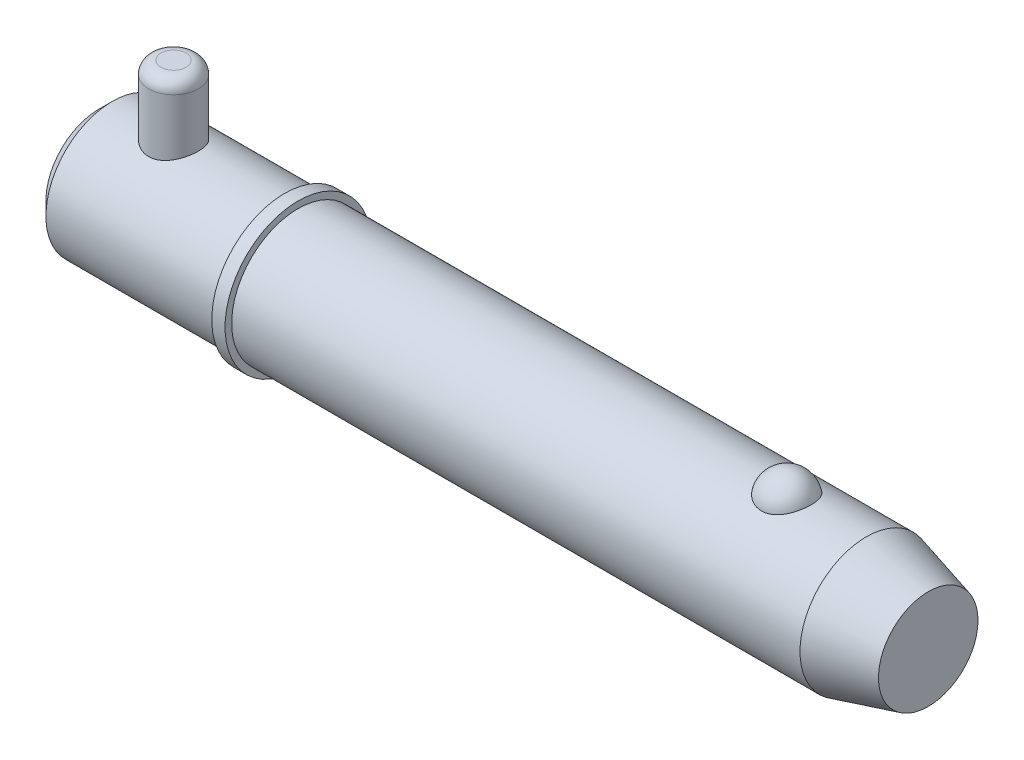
ISO-10303-21;
HEADER;
FILE_DESCRIPTION(('STEP AP214'),'2;1');
FILE_NAME('part.step','',(''),(''),'','','');
FILE_SCHEMA(('AUTOMOTIVE_DESIGN { 1 0 10303 214 1 1 1 1 }'));
ENDSEC;
DATA;
#1=APPLICATION_CONTEXT('core data for automotive mechanical design processes');
#2=APPLICATION_PROTOCOL_DEFINITION('international standard','automotive_design',2000,#1);
#3=PRODUCT_CONTEXT('',#1,'mechanical');
#4=PRODUCT('Part','Part','',(#3));
#5=PRODUCT_RELATED_PRODUCT_CATEGORY('part','',(#4));
#6=PRODUCT_DEFINITION_FORMATION('','',#4);
#7=PRODUCT_DEFINITION_CONTEXT('part definition',#1,'design');
#8=PRODUCT_DEFINITION('design','',#6,#7);
#9=PRODUCT_DEFINITION_SHAPE('','',#8);
#10=(LENGTH_UNIT() NAMED_UNIT(*) SI_UNIT(.MILLI.,.METRE.));
#11=(NAMED_UNIT(*) PLANE_ANGLE_UNIT() SI_UNIT($,.RADIAN.));
#12=(NAMED_UNIT(*) SI_UNIT($,.STERADIAN.) SOLID_ANGLE_UNIT());
#13=UNCERTAINTY_MEASURE_WITH_UNIT(LENGTH_MEASURE(1.E-05),#10,'distance_accuracy_value','');
#14=(GEOMETRIC_REPRESENTATION_CONTEXT(3) GLOBAL_UNCERTAINTY_ASSIGNED_CONTEXT((#13)) GLOBAL_UNIT_ASSIGNED_CONTEXT((#10,
#11,#12)) REPRESENTATION_CONTEXT('',''));
#15=CARTESIAN_POINT('',(0.,0.,0.));
#16=DIRECTION('',(0.,0.,1.));
#17=DIRECTION('',(1.,0.,0.));
#18=AXIS2_PLACEMENT_3D('',#15,#16,#17);
#19=CARTESIAN_POINT('',(14.28,25.4,0.));
#20=DIRECTION('',(0.,-1.,0.));
#21=DIRECTION('',(0.,0.,-1.));
#22=AXIS2_PLACEMENT_3D('',#19,#20,#21);
#23=CYLINDRICAL_SURFACE('',#22,4.76);
#24=CARTESIAN_POINT('',(14.28,-10.32,0.));
#25=DIRECTION('',(0.,1.,0.));
#26=DIRECTION('',(0.,0.,1.));
#27=AXIS2_PLACEMENT_3D('',#24,#25,#26);
#28=CIRCLE('',#27,4.76);
#29=CARTESIAN_POINT('',(14.28,-10.32,-4.76));
#30=VERTEX_POINT('',#29);
#31=EDGE_CURVE('P0_E25',#30,#30,#28,.T.);
#32=CARTESIAN_POINT('',(14.28,23.02,0.));
#33=DIRECTION('',(0.,1.,0.));
#34=DIRECTION('',(0.,0.,1.));
#35=AXIS2_PLACEMENT_3D('',#32,#33,#34);
#36=CIRCLE('',#35,4.76);
#37=CARTESIAN_POINT('',(14.28,23.02,-4.76));
#38=VERTEX_POINT('',#37);
#39=EDGE_CURVE('P0_E29',#38,#38,#36,.F.);
#40=CARTESIAN_POINT('',(14.28,-10.32,-4.76));
#41=CARTESIAN_POINT('',(14.28,-9.97270833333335,-4.76));
#42=CARTESIAN_POINT('',(14.28,-9.62541666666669,-4.76));
#43=CARTESIAN_POINT('',(14.28,-8.93083333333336,-4.76));
#44=CARTESIAN_POINT('',(14.28,-8.58354166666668,-4.76));
#45=CARTESIAN_POINT('',(14.28,-7.88895833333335,-4.76));
#46=CARTESIAN_POINT('',(14.28,-7.54166666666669,-4.76));
#47=CARTESIAN_POINT('',(14.28,-6.84708333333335,-4.76));
#48=CARTESIAN_POINT('',(14.28,-6.49979166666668,-4.76));
#49=CARTESIAN_POINT('',(14.28,-5.80520833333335,-4.76));
#50=CARTESIAN_POINT('',(14.28,-5.45791666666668,-4.76));
#51=CARTESIAN_POINT('',(14.28,-4.76333333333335,-4.76));
#52=CARTESIAN_POINT('',(14.28,-4.41604166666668,-4.76));
#53=CARTESIAN_POINT('',(14.28,-3.72145833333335,-4.76));
#54=CARTESIAN_POINT('',(14.28,-3.37416666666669,-4.76));
#55=CARTESIAN_POINT('',(14.28,-2.67958333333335,-4.76));
#56=CARTESIAN_POINT('',(14.28,-2.33229166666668,-4.76));
#57=CARTESIAN_POINT('',(14.28,-1.63770833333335,-4.76));
#58=CARTESIAN_POINT('',(14.28,-1.29041666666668,-4.76));
#59=CARTESIAN_POINT('',(14.28,-0.595833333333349,-4.76));
#60=CARTESIAN_POINT('',(14.28,-0.24854166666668,-4.76));
#61=CARTESIAN_POINT('',(14.28,0.446041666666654,-4.76));
#62=CARTESIAN_POINT('',(14.28,0.793333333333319,-4.76));
#63=CARTESIAN_POINT('',(14.28,1.48791666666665,-4.76));
#64=CARTESIAN_POINT('',(14.28,1.83520833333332,-4.76));
#65=CARTESIAN_POINT('',(14.28,2.52979166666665,-4.76));
#66=CARTESIAN_POINT('',(14.28,2.87708333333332,-4.76));
#67=CARTESIAN_POINT('',(14.28,3.57166666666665,-4.76));
#68=CARTESIAN_POINT('',(14.28,3.91895833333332,-4.76));
#69=CARTESIAN_POINT('',(14.28,4.61354166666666,-4.76));
#70=CARTESIAN_POINT('',(14.28,4.96083333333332,-4.76));
#71=CARTESIAN_POINT('',(14.28,5.65541666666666,-4.76));
#72=CARTESIAN_POINT('',(14.28,6.00270833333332,-4.76));
#73=CARTESIAN_POINT('',(14.28,6.69729166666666,-4.76));
#74=CARTESIAN_POINT('',(14.28,7.04458333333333,-4.76));
#75=CARTESIAN_POINT('',(14.28,7.73916666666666,-4.76));
#76=CARTESIAN_POINT('',(14.28,8.08645833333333,-4.76));
#77=CARTESIAN_POINT('',(14.28,8.78104166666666,-4.76));
#78=CARTESIAN_POINT('',(14.28,9.12833333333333,-4.76));
#79=CARTESIAN_POINT('',(14.28,9.82291666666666,-4.76));
#80=CARTESIAN_POINT('',(14.28,10.1702083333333,-4.76));
#81=CARTESIAN_POINT('',(14.28,10.8647916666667,-4.76));
#82=CARTESIAN_POINT('',(14.28,11.2120833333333,-4.76));
#83=CARTESIAN_POINT('',(14.28,11.9066666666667,-4.76));
#84=CARTESIAN_POINT('',(14.28,12.2539583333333,-4.76));
#85=CARTESIAN_POINT('',(14.28,12.9485416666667,-4.76));
#86=CARTESIAN_POINT('',(14.28,13.2958333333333,-4.76));
#87=CARTESIAN_POINT('',(14.28,13.9904166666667,-4.76));
#88=CARTESIAN_POINT('',(14.28,14.3377083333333,-4.76));
#89=CARTESIAN_POINT('',(14.28,15.0322916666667,-4.76));
#90=CARTESIAN_POINT('',(14.28,15.3795833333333,-4.76));
#91=CARTESIAN_POINT('',(14.28,16.0741666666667,-4.76));
#92=CARTESIAN_POINT('',(14.28,16.4214583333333,-4.76));
#93=CARTESIAN_POINT('',(14.28,17.1160416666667,-4.76));
#94=CARTESIAN_POINT('',(14.28,17.4633333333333,-4.76));
#95=CARTESIAN_POINT('',(14.28,18.1579166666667,-4.76));
#96=CARTESIAN_POINT('',(14.28,18.5052083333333,-4.76));
#97=CARTESIAN_POINT('',(14.28,19.1997916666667,-4.76));
#98=CARTESIAN_POINT('',(14.28,19.5470833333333,-4.76));
#99=CARTESIAN_POINT('',(14.28,20.2416666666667,-4.76));
#100=CARTESIAN_POINT('',(14.28,20.5889583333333,-4.76));
#101=CARTESIAN_POINT('',(14.28,21.2835416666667,-4.76));
#102=CARTESIAN_POINT('',(14.28,21.6308333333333,-4.76));
#103=CARTESIAN_POINT('',(14.28,22.3254166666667,-4.76));
#104=CARTESIAN_POINT('',(14.28,22.6727083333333,-4.76));
#105=CARTESIAN_POINT('',(14.28,23.02,-4.76));
#106=B_SPLINE_CURVE_WITH_KNOTS('',3,(#40,#41,#42,#43,#44,#45,#46,#47,#48,#49,#50,#51,#52,#53,
#54,#55,#56,#57,#58,#59,#60,#61,#62,#63,#64,#65,#66,#67,#68,#69,#70,#71,#72,#73,#74,#75,#76,#77,
#78,#79,#80,#81,#82,#83,#84,#85,#86,#87,#88,#89,#90,#91,#92,#93,#94,#95,#96,#97,#98,#99,#100,
#101,#102,#103,#104,#105),.UNSPECIFIED.,.F.,.F.,(4,2,2,2,2,2,2,2,2,2,2,2,2,2,2,2,2,2,2,2,2,2,2,
2,2,2,2,2,2,2,2,2,4),(0.,1.041875,2.08375,3.125625,4.1675,5.209375,6.25125,7.293125,
8.33500000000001,9.376875,10.41875,11.460625,12.5025,13.544375,14.58625,15.628125,16.67,
17.711875,18.75375,19.795625,20.8375,21.879375,22.92125,23.963125,25.005,26.046875,27.08875,
28.130625,29.1725,30.214375,31.25625,32.298125,33.34),.UNSPECIFIED.);
#107=EDGE_CURVE('P0_BSEAM14',#30,#38,#106,.T.);
#108=ORIENTED_EDGE('',*,*,#31,.T.);
#109=ORIENTED_EDGE('',*,*,#39,.T.);
#110=ORIENTED_EDGE('',*,*,#107,.T.);
#111=ORIENTED_EDGE('',*,*,#107,.F.);
#112=EDGE_LOOP('',(#108,#110,#109,#111));
#113=FACE_BOUND('',#112,.T.);
#114=ADVANCED_FACE('P0_F14',(#113),#23,.T.);
#115=CARTESIAN_POINT('',(14.28,25.4,0.));
#116=DIRECTION('',(0.,1.,0.));
#117=DIRECTION('',(0.,0.,1.));
#118=AXIS2_PLACEMENT_3D('',#115,#116,#117);
#119=PLANE('',#118);
#120=CARTESIAN_POINT('',(14.28,25.4,0.));
#121=DIRECTION('',(0.,1.,0.));
#122=DIRECTION('',(0.,0.,1.));
#123=AXIS2_PLACEMENT_3D('',#120,#121,#122);
#124=CIRCLE('',#123,2.38);
#125=CARTESIAN_POINT('',(14.28,25.4,2.38));
#126=VERTEX_POINT('',#125);
#127=EDGE_CURVE('P0_E10',#126,#126,#124,.T.);
#128=ORIENTED_EDGE('',*,*,#127,.T.);
#129=EDGE_LOOP('',(#128));
#130=FACE_BOUND('',#129,.T.);
#131=ADVANCED_FACE('P0_F46',(#130),#119,.T.);
#132=CARTESIAN_POINT('',(14.28,-12.7,0.));
#133=DIRECTION('',(0.,1.,0.));
#134=DIRECTION('',(0.,0.,1.));
#135=AXIS2_PLACEMENT_3D('',#132,#133,#134);
#136=PLANE('',#135);
#137=CARTESIAN_POINT('',(14.28,-12.7,0.));
#138=DIRECTION('',(0.,1.,0.));
#139=DIRECTION('',(0.,0.,1.));
#140=AXIS2_PLACEMENT_3D('',#137,#138,#139);
#141=CIRCLE('',#140,2.38);
#142=CARTESIAN_POINT('',(14.28,-12.7,2.38));
#143=VERTEX_POINT('',#142);
#144=EDGE_CURVE('P0_E21',#143,#143,#141,.F.);
#145=ORIENTED_EDGE('',*,*,#144,.T.);
#146=EDGE_LOOP('',(#145));
#147=FACE_BOUND('',#146,.T.);
#148=ADVANCED_FACE('P0_F43',(#147),#136,.F.);
#149=CARTESIAN_POINT('',(14.28,-10.32,0.));
#150=DIRECTION('',(0.,1.,0.));
#151=DIRECTION('',(0.,0.,1.));
#152=AXIS2_PLACEMENT_3D('',#149,#150,#151);
#153=DEGENERATE_TOROIDAL_SURFACE('',#152,2.38,2.38,.T.);
#154=ORIENTED_EDGE('',*,*,#144,.F.);
#155=EDGE_LOOP('',(#154));
#156=FACE_BOUND('',#155,.T.);
#157=ORIENTED_EDGE('',*,*,#31,.F.);
#158=EDGE_LOOP('',(#157));
#159=FACE_BOUND('',#158,.T.);
#160=ADVANCED_FACE('P0_F38',(#156,#159),#153,.T.);
#161=CARTESIAN_POINT('',(14.28,23.02,0.));
#162=DIRECTION('',(0.,1.,0.));
#163=DIRECTION('',(0.,0.,1.));
#164=AXIS2_PLACEMENT_3D('',#161,#162,#163);
#165=DEGENERATE_TOROIDAL_SURFACE('',#164,2.38,2.38,.T.);
#166=ORIENTED_EDGE('',*,*,#39,.F.);
#167=EDGE_LOOP('',(#166));
#168=FACE_BOUND('',#167,.T.);
#169=ORIENTED_EDGE('',*,*,#127,.F.);
#170=EDGE_LOOP('',(#169));
#171=FACE_BOUND('',#170,.T.);
#172=ADVANCED_FACE('P0_F16',(#168,#171),#165,.T.);
#173=CLOSED_SHELL('',(#114,#131,#148,#160,#172));
#174=MANIFOLD_SOLID_BREP('P0_B1',#173);
#175=CARTESIAN_POINT('',(0.,0.,0.));
#176=DIRECTION('',(1.,0.,0.));
#177=DIRECTION('',(0.,0.,-1.));
#178=AXIS2_PLACEMENT_3D('',#175,#176,#177);
#179=CYLINDRICAL_SURFACE('',#178,12.7);
#180=CARTESIAN_POINT('',(146.900738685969,0.,0.));
#181=DIRECTION('',(1.,0.,0.));
#182=DIRECTION('',(0.,0.,-1.));
#183=AXIS2_PLACEMENT_3D('',#180,#181,#182);
#184=CIRCLE('',#183,12.7);
#185=CARTESIAN_POINT('',(146.900738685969,0.,-12.7));
#186=VERTEX_POINT('',#185);
#187=EDGE_CURVE('P1_E81',#186,#186,#184,.T.);
#188=ORIENTED_EDGE('',*,*,#187,.F.);
#189=EDGE_LOOP('',(#188));
#190=FACE_BOUND('',#189,.T.);
#191=CARTESIAN_POINT('',(38.1,0.,0.));
#192=DIRECTION('',(1.,0.,0.));
#193=DIRECTION('',(0.,0.,-1.));
#194=AXIS2_PLACEMENT_3D('',#191,#192,#193);
#195=CIRCLE('',#194,12.7);
#196=CARTESIAN_POINT('',(38.1,0.,-12.7));
#197=VERTEX_POINT('',#196);
#198=EDGE_CURVE('P1_E85',#197,#197,#195,.T.);
#199=ORIENTED_EDGE('',*,*,#198,.T.);
#200=EDGE_LOOP('',(#199));
#201=FACE_BOUND('',#200,.T.);
#202=CARTESIAN_POINT('',(131.660042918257,11.7500437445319,4.81938502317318));
#203=CARTESIAN_POINT('',(131.535088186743,11.7500430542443,4.81938571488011));
#204=CARTESIAN_POINT('',(131.410144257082,11.7520975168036,4.81438658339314));
#205=CARTESIAN_POINT('',(131.161142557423,11.760253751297,4.79442904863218));
#206=CARTESIAN_POINT('',(131.037085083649,11.7663568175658,4.77946746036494));
#207=CARTESIAN_POINT('',(130.790901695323,11.7824262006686,4.7397141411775));
#208=CARTESIAN_POINT('',(130.668774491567,11.7923898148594,4.71492928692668));
#209=CARTESIAN_POINT('',(130.427187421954,11.8158938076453,4.65571340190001));
#210=CARTESIAN_POINT('',(130.30772859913,11.8294355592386,4.6212786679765));
#211=CARTESIAN_POINT('',(130.072557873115,11.8596812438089,4.54309502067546));
#212=CARTESIAN_POINT('',(129.956839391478,11.8763792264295,4.49936361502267));
#213=CARTESIAN_POINT('',(129.729653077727,11.9124878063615,4.40287235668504));
#214=CARTESIAN_POINT('',(129.618186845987,11.9318994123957,4.35010914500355));
#215=CARTESIAN_POINT('',(129.291278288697,11.9934256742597,4.17881316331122));
#216=CARTESIAN_POINT('',(129.083127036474,12.038858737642,4.04720756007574));
#217=CARTESIAN_POINT('',(128.685850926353,12.1352173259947,3.748564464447));
#218=CARTESIAN_POINT('',(128.497443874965,12.1862630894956,3.58061821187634));
#219=CARTESIAN_POINT('',(128.150521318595,12.2875163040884,3.21600758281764));
#220=CARTESIAN_POINT('',(127.992011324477,12.3377235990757,3.0193379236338));
#221=CARTESIAN_POINT('',(127.70168878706,12.4344923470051,2.592916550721));
#222=CARTESIAN_POINT('',(127.571376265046,12.4807925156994,2.36208286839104));
#223=CARTESIAN_POINT('',(127.349407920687,12.5623454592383,1.88070399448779));
#224=CARTESIAN_POINT('',(127.257755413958,12.5975972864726,1.63015711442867));
#225=CARTESIAN_POINT('',(127.114046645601,12.6538414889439,1.1129886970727));
#226=CARTESIAN_POINT('',(127.062499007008,12.6746503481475,0.846205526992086));
#227=CARTESIAN_POINT('',(127.001977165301,12.699153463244,0.307085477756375));
#228=CARTESIAN_POINT('',(126.993001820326,12.7028481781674,0.034748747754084));
#229=CARTESIAN_POINT('',(127.017731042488,12.6927785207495,-0.506073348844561));
#230=CARTESIAN_POINT('',(127.051189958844,12.6791146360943,-0.774571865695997));
#231=CARTESIAN_POINT('',(127.159687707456,12.635882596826,-1.30170246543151));
#232=CARTESIAN_POINT('',(127.23472729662,12.606314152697,-1.56033436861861));
#233=CARTESIAN_POINT('',(127.42500006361,12.5342328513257,-2.0608389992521));
#234=CARTESIAN_POINT('',(127.540287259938,12.4917026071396,-2.30268867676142));
#235=CARTESIAN_POINT('',(127.808704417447,12.3981123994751,-2.76259600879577));
#236=CARTESIAN_POINT('',(127.961837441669,12.3470517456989,-2.98065173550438));
#237=CARTESIAN_POINT('',(128.303507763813,12.2416045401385,-3.38786328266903));
#238=CARTESIAN_POINT('',(128.492201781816,12.1872040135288,-3.57688418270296));
#239=CARTESIAN_POINT('',(128.900239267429,12.0814086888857,-3.91941073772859));
#240=CARTESIAN_POINT('',(129.119580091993,12.0300136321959,-4.07291945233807));
#241=CARTESIAN_POINT('',(129.578375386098,11.9373542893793,-4.33691289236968));
#242=CARTESIAN_POINT('',(129.817304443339,11.8958982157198,-4.44824125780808));
#243=CARTESIAN_POINT('',(130.31243761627,11.8268116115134,-4.62881985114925));
#244=CARTESIAN_POINT('',(130.568635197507,11.7991758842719,-4.69808589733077));
#245=CARTESIAN_POINT('',(131.077164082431,11.7622209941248,-4.78983181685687));
#246=CARTESIAN_POINT('',(131.329041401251,11.7520502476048,-4.81449025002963));
#247=CARTESIAN_POINT('',(131.833573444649,11.7485796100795,-4.82295735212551));
#248=CARTESIAN_POINT('',(132.086228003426,11.7552763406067,-4.80677420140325));
#249=CARTESIAN_POINT('',(132.576834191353,11.7842584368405,-4.73525430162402));
#250=CARTESIAN_POINT('',(132.814998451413,11.8060486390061,-4.68116061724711));
#251=CARTESIAN_POINT('',(133.278489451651,11.8622750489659,-4.53678133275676));
#252=CARTESIAN_POINT('',(133.503815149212,11.8967122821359,-4.44649279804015));
#253=CARTESIAN_POINT('',(133.940801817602,11.9754603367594,-4.2298761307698));
#254=CARTESIAN_POINT('',(134.152057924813,12.0199699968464,-4.10280539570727));
#255=CARTESIAN_POINT('',(134.550601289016,12.1138028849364,-3.81685409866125));
#256=CARTESIAN_POINT('',(134.737883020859,12.163127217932,-3.65796622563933));
#257=CARTESIAN_POINT('',(135.093350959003,12.2642343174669,-3.30364864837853));
#258=CARTESIAN_POINT('',(135.260111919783,12.3160165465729,-3.10678783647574));
#259=CARTESIAN_POINT('',(135.559579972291,12.4142566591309,-2.68748409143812));
#260=CARTESIAN_POINT('',(135.692280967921,12.4607135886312,-2.4650365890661));
#261=CARTESIAN_POINT('',(135.924691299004,12.5450236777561,-1.9928951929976));
#262=CARTESIAN_POINT('',(136.023215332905,12.5825557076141,-1.74255918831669));
#263=CARTESIAN_POINT('',(136.179227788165,12.6431720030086,-1.22773734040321));
#264=CARTESIAN_POINT('',(136.236715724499,12.6662560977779,-0.963251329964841));
#265=CARTESIAN_POINT('',(136.309544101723,12.6956486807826,-0.4273550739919));
#266=CARTESIAN_POINT('',(136.324837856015,12.7019385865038,-0.155937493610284));
#267=CARTESIAN_POINT('',(136.312779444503,12.6970201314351,0.38592890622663));
#268=CARTESIAN_POINT('',(136.28542805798,12.6858120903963,0.656377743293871));
#269=CARTESIAN_POINT('',(136.213060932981,12.6568455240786,1.05454017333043));
#270=CARTESIAN_POINT('',(136.183796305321,12.6451962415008,1.185778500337));
#271=CARTESIAN_POINT('',(136.115022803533,12.6181819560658,1.44513808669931));
#272=CARTESIAN_POINT('',(136.075517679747,12.6028183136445,1.57326046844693));
#273=CARTESIAN_POINT('',(135.986439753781,12.5687547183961,1.82554978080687));
#274=CARTESIAN_POINT('',(135.936862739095,12.5500533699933,1.94971503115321));
#275=CARTESIAN_POINT('',(135.82792115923,12.5098093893,2.19314370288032));
#276=CARTESIAN_POINT('',(135.768560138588,12.4882677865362,2.31240887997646));
#277=CARTESIAN_POINT('',(135.63997128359,12.4427679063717,2.5459303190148));
#278=CARTESIAN_POINT('',(135.570688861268,12.4187964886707,2.66015396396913));
#279=CARTESIAN_POINT('',(135.422903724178,12.3691892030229,2.88202659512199));
#280=CARTESIAN_POINT('',(135.344404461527,12.3435539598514,2.98967802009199));
#281=CARTESIAN_POINT('',(135.178550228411,12.2912955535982,3.1977438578));
#282=CARTESIAN_POINT('',(135.091191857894,12.2646720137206,3.29815546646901));
#283=CARTESIAN_POINT('',(134.908161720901,12.2111945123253,3.49095035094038));
#284=CARTESIAN_POINT('',(134.812493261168,12.1843406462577,3.58333679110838));
#285=CARTESIAN_POINT('',(134.613627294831,12.1312249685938,3.75922876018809));
#286=CARTESIAN_POINT('',(134.510450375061,12.104961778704,3.84275713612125));
#287=CARTESIAN_POINT('',(134.29701336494,12.0537284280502,4.00056406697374));
#288=CARTESIAN_POINT('',(134.186756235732,12.028757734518,4.07484645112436));
#289=CARTESIAN_POINT('',(133.959755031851,11.9808306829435,4.21367959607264));
#290=CARTESIAN_POINT('',(133.843006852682,11.9578756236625,4.27822410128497));
#291=CARTESIAN_POINT('',(133.60394258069,11.9147184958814,4.39698483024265));
#292=CARTESIAN_POINT('',(133.481628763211,11.894515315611,4.45120522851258));
#293=CARTESIAN_POINT('',(133.222952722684,11.8561129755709,4.55255353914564));
#294=CARTESIAN_POINT('',(133.086223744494,11.8381764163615,4.59884858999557));
#295=CARTESIAN_POINT('',(132.808608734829,11.8069093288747,4.67853897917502));
#296=CARTESIAN_POINT('',(132.667724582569,11.7935767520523,4.71194005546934));
#297=CARTESIAN_POINT('',(132.38309446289,11.7720277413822,4.76552188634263));
#298=CARTESIAN_POINT('',(132.239348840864,11.7638106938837,4.78570422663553));
#299=CARTESIAN_POINT('',(131.950411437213,11.7528195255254,4.81263433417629));
#300=CARTESIAN_POINT('',(131.805219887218,11.7500445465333,4.81938421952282));
#301=CARTESIAN_POINT('',(131.660042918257,11.7500437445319,4.81938502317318));
#302=B_SPLINE_CURVE_WITH_KNOTS('',3,(#202,#203,#204,#205,#206,#207,#208,#209,#210,#211,#212,
#213,#214,#215,#216,#217,#218,#219,#220,#221,#222,#223,#224,#225,#226,#227,#228,#229,#230,#231,
#232,#233,#234,#235,#236,#237,#238,#239,#240,#241,#242,#243,#244,#245,#246,#247,#248,#249,#250,
#251,#252,#253,#254,#255,#256,#257,#258,#259,#260,#261,#262,#263,#264,#265,#266,#267,#268,#269,
#270,#271,#272,#273,#274,#275,#276,#277,#278,#279,#280,#281,#282,#283,#284,#285,#286,#287,#288,
#289,#290,#291,#292,#293,#294,#295,#296,#297,#298,#299,#300,#301),.UNSPECIFIED.,.T.,.F.,(4,2,2,
2,2,2,2,2,2,2,2,2,2,2,2,2,2,2,2,2,2,2,2,2,2,2,2,2,2,2,2,2,2,2,2,2,2,2,2,2,2,2,2,2,2,2,2,2,2,4),
(0.,0.374729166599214,0.749578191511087,1.12416526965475,1.49889629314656,1.87292776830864,
2.24709865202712,2.99481328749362,3.76399449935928,4.53331735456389,5.3368391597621,
6.14042986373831,6.95405296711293,7.76765424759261,8.57656703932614,9.38549455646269,
10.1955119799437,11.0055949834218,11.8193353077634,12.6330054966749,13.4294141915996,
14.2255231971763,14.9815786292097,15.7374826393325,16.4696948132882,17.2019663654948,
17.9501979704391,18.6986017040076,19.4844704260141,20.2704797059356,21.0815215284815,
21.8925729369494,22.7045213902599,23.5164550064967,23.9209608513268,24.3253187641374,
24.7298461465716,25.1342272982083,25.54092555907,25.9474719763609,26.3541750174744,
26.7607169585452,27.1661834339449,27.5714814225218,27.9770386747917,28.3824315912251,
28.818120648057,29.2536155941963,29.6890582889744,30.1244323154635),.UNSPECIFIED.);
#303=CARTESIAN_POINT('',(131.660042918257,11.7500437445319,4.81938502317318));
#304=VERTEX_POINT('',#303);
#305=EDGE_CURVE('P1_E35',#304,#304,#302,.T.);
#306=ORIENTED_EDGE('',*,*,#305,.T.);
#307=EDGE_LOOP('',(#306));
#308=FACE_BOUND('',#307,.T.);
#309=ADVANCED_FACE('P1_F13',(#190,#201,#308),#179,.T.);
#310=CARTESIAN_POINT('',(0.,0.,0.));
#311=DIRECTION('',(-1.,0.,0.));
#312=DIRECTION('',(0.,0.,1.));
#313=AXIS2_PLACEMENT_3D('',#310,#311,#312);
#314=PLANE('',#313);
#315=CARTESIAN_POINT('',(0.,0.,0.));
#316=DIRECTION('',(1.,0.,0.));
#317=DIRECTION('',(0.,0.,-1.));
#318=AXIS2_PLACEMENT_3D('',#315,#316,#317);
#319=CIRCLE('',#318,10.16);
#320=CARTESIAN_POINT('',(0.,0.,-10.16));
#321=VERTEX_POINT('',#320);
#322=EDGE_CURVE('P1_E9',#321,#321,#319,.T.);
#323=ORIENTED_EDGE('',*,*,#322,.F.);
#324=EDGE_LOOP('',(#323));
#325=FACE_BOUND('',#324,.T.);
#326=ADVANCED_FACE('P1_F15',(#325),#314,.T.);
#327=CARTESIAN_POINT('',(2.53999999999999,0.,0.));
#328=DIRECTION('',(1.,0.,0.));
#329=DIRECTION('',(0.,0.,-1.));
#330=AXIS2_PLACEMENT_3D('',#327,#328,#329);
#331=CONICAL_SURFACE('',#330,12.7,0.78539816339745);
#332=ORIENTED_EDGE('',*,*,#322,.T.);
#333=EDGE_LOOP('',(#332));
#334=FACE_BOUND('',#333,.T.);
#335=CARTESIAN_POINT('',(2.53999999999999,0.,0.));
#336=DIRECTION('',(1.,0.,0.));
#337=DIRECTION('',(0.,0.,-1.));
#338=AXIS2_PLACEMENT_3D('',#335,#336,#337);
#339=CIRCLE('',#338,12.7);
#340=CARTESIAN_POINT('',(2.53999999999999,0.,-12.7));
#341=VERTEX_POINT('',#340);
#342=EDGE_CURVE('P1_E26',#341,#341,#339,.T.);
#343=ORIENTED_EDGE('',*,*,#342,.F.);
#344=EDGE_LOOP('',(#343));
#345=FACE_BOUND('',#344,.T.);
#346=ADVANCED_FACE('P1_F77',(#334,#345),#331,.T.);
#347=CARTESIAN_POINT('',(0.,0.,0.));
#348=DIRECTION('',(1.,0.,0.));
#349=DIRECTION('',(0.,0.,-1.));
#350=AXIS2_PLACEMENT_3D('',#347,#348,#349);
#351=CYLINDRICAL_SURFACE('',#350,12.7);
#352=CARTESIAN_POINT('',(14.28,-11.7742260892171,4.76));
#353=CARTESIAN_POINT('',(14.1514948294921,-11.7742255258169,4.76000061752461));
#354=CARTESIAN_POINT('',(14.0229980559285,-11.7763355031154,4.75479194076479));
#355=CARTESIAN_POINT('',(13.7669369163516,-11.7847043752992,4.73401198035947));
#356=CARTESIAN_POINT('',(13.6393728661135,-11.7909646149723,4.71843733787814));
#357=CARTESIAN_POINT('',(13.386226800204,-11.8074248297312,4.67709434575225));
#358=CARTESIAN_POINT('',(13.2606439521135,-11.8176231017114,4.65133040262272));
#359=CARTESIAN_POINT('',(13.0122434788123,-11.8416347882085,4.58985545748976));
#360=CARTESIAN_POINT('',(12.8894269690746,-11.8554496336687,4.55414051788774));
#361=CARTESIAN_POINT('',(12.6477622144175,-11.8862222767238,4.47320764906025));
#362=CARTESIAN_POINT('',(12.5289037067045,-11.9031710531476,4.4280169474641));
#363=CARTESIAN_POINT('',(12.2955059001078,-11.939736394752,4.32845291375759));
#364=CARTESIAN_POINT('',(12.1809682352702,-11.9593539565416,4.2740761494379));
#365=CARTESIAN_POINT('',(11.8448901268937,-12.0213893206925,4.09777237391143));
#366=CARTESIAN_POINT('',(11.6307077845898,-12.0670135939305,3.9626122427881));
#367=CARTESIAN_POINT('',(11.2179129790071,-12.1641514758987,3.65386230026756));
#368=CARTESIAN_POINT('',(11.0204399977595,-12.2158379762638,3.47881300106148));
#369=CARTESIAN_POINT('',(10.6568212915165,-12.3178468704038,3.09829182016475));
#370=CARTESIAN_POINT('',(10.4906822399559,-12.3681689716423,2.89281347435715));
#371=CARTESIAN_POINT('',(10.1890299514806,-12.4638367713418,2.44867909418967));
#372=CARTESIAN_POINT('',(10.054749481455,-12.5089552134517,2.20913281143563));
#373=CARTESIAN_POINT('',(9.82886079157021,-12.5870472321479,1.70885919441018));
#374=CARTESIAN_POINT('',(9.73723778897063,-12.620025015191,1.44813923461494));
#375=CARTESIAN_POINT('',(9.60324488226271,-12.6688874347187,0.9248423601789));
#376=CARTESIAN_POINT('',(9.55892269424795,-12.6854474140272,0.662829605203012));
#377=CARTESIAN_POINT('',(9.5145335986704,-12.7020320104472,0.134596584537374));
#378=CARTESIAN_POINT('',(9.5144523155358,-12.7020619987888,-0.131622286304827));
#379=CARTESIAN_POINT('',(9.55741019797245,-12.6860129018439,-0.646717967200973));
#380=CARTESIAN_POINT('',(9.59831845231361,-12.6707298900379,-0.895801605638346));
#381=CARTESIAN_POINT('',(9.71850987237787,-12.6268158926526,-1.38327219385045));
#382=CARTESIAN_POINT('',(9.79779575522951,-12.5981839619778,-1.62165838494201));
#383=CARTESIAN_POINT('',(9.99348296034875,-12.5298894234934,-2.08508424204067));
#384=CARTESIAN_POINT('',(10.110407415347,-12.4900724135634,-2.30987931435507));
#385=CARTESIAN_POINT('',(10.3775896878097,-12.4034373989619,-2.7372158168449));
#386=CARTESIAN_POINT('',(10.5278582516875,-12.3566171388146,-2.93975004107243));
#387=CARTESIAN_POINT('',(10.8677318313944,-12.257571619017,-3.32936830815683));
#388=CARTESIAN_POINT('',(11.0591227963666,-12.2051903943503,-3.51485714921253));
#389=CARTESIAN_POINT('',(11.4706087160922,-12.1031155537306,-3.85170663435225));
#390=CARTESIAN_POINT('',(11.6907108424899,-12.0534226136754,-4.00305872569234));
#391=CARTESIAN_POINT('',(12.1596597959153,-11.9613684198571,-4.27038218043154));
#392=CARTESIAN_POINT('',(12.4090353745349,-11.9191939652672,-4.38549550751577));
#393=CARTESIAN_POINT('',(12.9256290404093,-11.8491124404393,-4.57149117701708));
#394=CARTESIAN_POINT('',(13.1928371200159,-11.8211974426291,-4.64239810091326));
#395=CARTESIAN_POINT('',(13.7217488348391,-11.7846654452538,-4.73434137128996));
#396=CARTESIAN_POINT('',(13.9829438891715,-11.7750694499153,-4.75791141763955));
#397=CARTESIAN_POINT('',(14.5056760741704,-11.7734909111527,-4.76182097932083));
#398=CARTESIAN_POINT('',(14.7672131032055,-11.7815039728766,-4.74217128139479));
#399=CARTESIAN_POINT('',(15.2702140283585,-11.8132466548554,-4.66249544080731));
#400=CARTESIAN_POINT('',(15.5120417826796,-11.8362133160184,-4.60442726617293));
#401=CARTESIAN_POINT('',(15.9824097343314,-11.8943704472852,-4.45202868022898));
#402=CARTESIAN_POINT('',(16.2109472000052,-11.9295634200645,-4.35769084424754));
#403=CARTESIAN_POINT('',(16.6577741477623,-12.0098310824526,-4.13144368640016));
#404=CARTESIAN_POINT('',(16.8753590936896,-12.055226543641,-3.99825937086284));
#405=CARTESIAN_POINT('',(17.2859732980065,-12.150238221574,-3.69949845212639));
#406=CARTESIAN_POINT('',(17.4789935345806,-12.19985597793,-3.5339100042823));
#407=CARTESIAN_POINT('',(17.8477707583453,-12.3015434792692,-3.1624728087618));
#408=CARTESIAN_POINT('',(18.0216609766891,-12.3535695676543,-2.95473880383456));
#409=CARTESIAN_POINT('',(18.254545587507,-12.426745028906,-2.62277433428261));
#410=CARTESIAN_POINT('',(18.3275489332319,-12.4503382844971,-2.50865480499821));
#411=CARTESIAN_POINT('',(18.463723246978,-12.4952713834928,-2.27428971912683));
#412=CARTESIAN_POINT('',(18.5268984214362,-12.5166121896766,-2.15404681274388));
#413=CARTESIAN_POINT('',(18.6427140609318,-12.5563817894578,-1.90858448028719));
#414=CARTESIAN_POINT('',(18.6953855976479,-12.5748191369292,-1.78338108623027));
#415=CARTESIAN_POINT('',(18.7899337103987,-12.6083284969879,-1.52857834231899));
#416=CARTESIAN_POINT('',(18.8318147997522,-12.6234019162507,-1.39898085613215));
#417=CARTESIAN_POINT('',(18.9043819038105,-12.6497495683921,-1.13633254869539));
#418=CARTESIAN_POINT('',(18.9350698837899,-12.6610244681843,-1.00328233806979));
#419=CARTESIAN_POINT('',(18.9849303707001,-12.6794412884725,-0.734761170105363));
#420=CARTESIAN_POINT('',(19.0041035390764,-12.6865834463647,-0.59929035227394));
#421=CARTESIAN_POINT('',(19.0299427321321,-12.6962286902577,-0.335006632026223));
#422=CARTESIAN_POINT('',(19.0372742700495,-12.698978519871,-0.206267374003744));
#423=CARTESIAN_POINT('',(19.0414668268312,-12.7005496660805,0.0514515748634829));
#424=CARTESIAN_POINT('',(19.038324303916,-12.69936965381,0.180431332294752));
#425=CARTESIAN_POINT('',(19.0215965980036,-12.6931114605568,0.437551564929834));
#426=CARTESIAN_POINT('',(19.0080165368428,-12.6880351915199,0.565692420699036));
#427=CARTESIAN_POINT('',(18.9705519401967,-12.6741222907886,0.820297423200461));
#428=CARTESIAN_POINT('',(18.9466635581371,-12.665284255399,0.946760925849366));
#429=CARTESIAN_POINT('',(18.8895279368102,-12.6443449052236,1.19395899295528));
#430=CARTESIAN_POINT('',(18.8565273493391,-12.6323299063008,1.3147578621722));
#431=CARTESIAN_POINT('',(18.781239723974,-12.6052503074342,1.55308888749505));
#432=CARTESIAN_POINT('',(18.738949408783,-12.5901846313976,1.67061987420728));
#433=CARTESIAN_POINT('',(18.5986461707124,-12.5409473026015,2.01714406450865));
#434=CARTESIAN_POINT('',(18.4871532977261,-12.502717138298,2.24027279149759));
#435=CARTESIAN_POINT('',(18.2262440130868,-12.4173042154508,2.6742599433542));
#436=CARTESIAN_POINT('',(18.0754310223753,-12.3698127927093,2.88420891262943));
#437=CARTESIAN_POINT('',(17.7421836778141,-12.271667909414,3.27675114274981));
#438=CARTESIAN_POINT('',(17.5597380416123,-12.2210133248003,3.45933459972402));
#439=CARTESIAN_POINT('',(17.2605468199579,-12.1452079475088,3.7138066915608));
#440=CARTESIAN_POINT('',(17.1535518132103,-12.119328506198,3.79719993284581));
#441=CARTESIAN_POINT('',(16.9326449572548,-12.0688597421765,3.95467398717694));
#442=CARTESIAN_POINT('',(16.8187356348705,-12.0442699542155,4.02875817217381));
#443=CARTESIAN_POINT('',(16.5846234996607,-11.9971053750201,4.16711104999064));
#444=CARTESIAN_POINT('',(16.4644172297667,-11.9745317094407,4.23137427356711));
#445=CARTESIAN_POINT('',(16.2185866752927,-11.9321360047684,4.34949041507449));
#446=CARTESIAN_POINT('',(16.09296473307,-11.9123127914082,4.40334777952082));
#447=CARTESIAN_POINT('',(15.8314769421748,-11.875268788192,4.50232278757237));
#448=CARTESIAN_POINT('',(15.6954035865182,-11.8582009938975,4.54695127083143));
#449=CARTESIAN_POINT('',(15.4194002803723,-11.8284328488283,4.62383807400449));
#450=CARTESIAN_POINT('',(15.2794720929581,-11.815730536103,4.6561019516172));
#451=CARTESIAN_POINT('',(14.9969657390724,-11.7951940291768,4.70788444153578));
#452=CARTESIAN_POINT('',(14.8543884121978,-11.7873583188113,4.72740702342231));
#453=CARTESIAN_POINT('',(14.5678704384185,-11.7768749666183,4.75346370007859));
#454=CARTESIAN_POINT('',(14.4239299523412,-11.7742267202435,4.75999930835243));
#455=CARTESIAN_POINT('',(14.28,-11.7742260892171,4.76));
#456=B_SPLINE_CURVE_WITH_KNOTS('',3,(#352,#353,#354,#355,#356,#357,#358,#359,#360,#361,#362,
#363,#364,#365,#366,#367,#368,#369,#370,#371,#372,#373,#374,#375,#376,#377,#378,#379,#380,#381,
#382,#383,#384,#385,#386,#387,#388,#389,#390,#391,#392,#393,#394,#395,#396,#397,#398,#399,#400,
#401,#402,#403,#404,#405,#406,#407,#408,#409,#410,#411,#412,#413,#414,#415,#416,#417,#418,#419,
#420,#421,#422,#423,#424,#425,#426,#427,#428,#429,#430,#431,#432,#433,#434,#435,#436,#437,#438,
#439,#440,#441,#442,#443,#444,#445,#446,#447,#448,#449,#450,#451,#452,#453,#454,#455),
.UNSPECIFIED.,.T.,.F.,(4,2,2,2,2,2,2,2,2,2,2,2,2,2,2,2,2,2,2,2,2,2,2,2,2,2,2,2,2,2,2,2,2,2,2,2,
2,2,2,2,2,2,2,2,2,2,2,2,2,2,2,4),(0.,0.385378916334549,0.770882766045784,1.15622008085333,
1.54171009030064,1.92610725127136,2.31064835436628,3.07917291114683,3.88239385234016,
4.68578566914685,5.51648193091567,6.34689010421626,7.14151420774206,7.93588010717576,
8.69098665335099,9.44614666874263,10.2122918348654,10.9786842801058,11.789876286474,
12.6012713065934,13.4306405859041,14.2595482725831,15.0427613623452,15.8257790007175,
16.5716820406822,17.3177378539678,18.0917395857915,18.8660247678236,19.6893332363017,
20.1014571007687,20.5134040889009,20.9241137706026,21.3346513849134,21.7451168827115,
22.1555587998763,22.542011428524,22.928594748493,23.3149884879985,23.7015265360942,
24.0784835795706,24.4555738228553,25.2091300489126,25.994347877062,26.7798463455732,
27.1937428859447,27.6074890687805,28.0214648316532,28.4352633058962,28.8672794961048,
29.299101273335,29.7307884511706,30.1624253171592),.UNSPECIFIED.);
#457=CARTESIAN_POINT('',(14.28,-11.7742260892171,4.76));
#458=VERTEX_POINT('',#457);
#459=EDGE_CURVE('P1_E17',#458,#458,#456,.T.);
#460=ORIENTED_EDGE('',*,*,#459,.F.);
#461=EDGE_LOOP('',(#460));
#462=FACE_BOUND('',#461,.T.);
#463=CARTESIAN_POINT('',(14.28,11.7742260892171,4.76));
#464=CARTESIAN_POINT('',(14.4085051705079,11.7742255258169,4.76000061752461));
#465=CARTESIAN_POINT('',(14.5370019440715,11.7763355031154,4.75479194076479));
#466=CARTESIAN_POINT('',(14.7930630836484,11.7847043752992,4.73401198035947));
#467=CARTESIAN_POINT('',(14.9206271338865,11.7909646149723,4.71843733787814));
#468=CARTESIAN_POINT('',(15.173773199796,11.8074248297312,4.67709434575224));
#469=CARTESIAN_POINT('',(15.2993560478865,11.8176231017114,4.65133040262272));
#470=CARTESIAN_POINT('',(15.5477565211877,11.8416347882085,4.58985545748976));
#471=CARTESIAN_POINT('',(15.6705730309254,11.8554496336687,4.55414051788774));
#472=CARTESIAN_POINT('',(15.9122377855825,11.8862222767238,4.47320764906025));
#473=CARTESIAN_POINT('',(16.0310962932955,11.9031710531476,4.4280169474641));
#474=CARTESIAN_POINT('',(16.2644940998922,11.939736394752,4.32845291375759));
#475=CARTESIAN_POINT('',(16.3790317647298,11.9593539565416,4.2740761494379));
#476=CARTESIAN_POINT('',(16.7151098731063,12.0213893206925,4.09777237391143));
#477=CARTESIAN_POINT('',(16.9292922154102,12.0670135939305,3.96261224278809));
#478=CARTESIAN_POINT('',(17.3420870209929,12.1641514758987,3.65386230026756));
#479=CARTESIAN_POINT('',(17.5395600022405,12.2158379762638,3.47881300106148));
#480=CARTESIAN_POINT('',(17.9031787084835,12.3178468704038,3.09829182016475));
#481=CARTESIAN_POINT('',(18.0693177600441,12.3681689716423,2.89281347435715));
#482=CARTESIAN_POINT('',(18.3709700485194,12.4638367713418,2.44867909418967));
#483=CARTESIAN_POINT('',(18.505250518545,12.5089552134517,2.20913281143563));
#484=CARTESIAN_POINT('',(18.7311392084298,12.5870472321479,1.70885919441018));
#485=CARTESIAN_POINT('',(18.8227622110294,12.620025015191,1.44813923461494));
#486=CARTESIAN_POINT('',(18.9567551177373,12.6688874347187,0.924842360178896));
#487=CARTESIAN_POINT('',(19.0010773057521,12.6854474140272,0.662829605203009));
#488=CARTESIAN_POINT('',(19.0454664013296,12.7020320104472,0.134596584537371));
#489=CARTESIAN_POINT('',(19.0455476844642,12.7020619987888,-0.13162228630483));
#490=CARTESIAN_POINT('',(19.0025898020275,12.6860129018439,-0.646717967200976));
#491=CARTESIAN_POINT('',(18.9616815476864,12.6707298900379,-0.89580160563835));
#492=CARTESIAN_POINT('',(18.8414901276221,12.6268158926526,-1.38327219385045));
#493=CARTESIAN_POINT('',(18.7622042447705,12.5981839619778,-1.62165838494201));
#494=CARTESIAN_POINT('',(18.5665170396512,12.5298894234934,-2.08508424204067));
#495=CARTESIAN_POINT('',(18.449592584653,12.4900724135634,-2.30987931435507));
#496=CARTESIAN_POINT('',(18.1824103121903,12.4034373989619,-2.7372158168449));
#497=CARTESIAN_POINT('',(18.0321417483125,12.3566171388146,-2.93975004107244));
#498=CARTESIAN_POINT('',(17.6922681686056,12.257571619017,-3.32936830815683));
#499=CARTESIAN_POINT('',(17.5008772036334,12.2051903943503,-3.51485714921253));
#500=CARTESIAN_POINT('',(17.0893912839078,12.1031155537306,-3.85170663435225));
#501=CARTESIAN_POINT('',(16.8692891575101,12.0534226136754,-4.00305872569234));
#502=CARTESIAN_POINT('',(16.4003402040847,11.9613684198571,-4.27038218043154));
#503=CARTESIAN_POINT('',(16.1509646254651,11.9191939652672,-4.38549550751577));
#504=CARTESIAN_POINT('',(15.6343709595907,11.8491124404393,-4.57149117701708));
#505=CARTESIAN_POINT('',(15.367162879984,11.8211974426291,-4.64239810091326));
#506=CARTESIAN_POINT('',(14.8382511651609,11.7846654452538,-4.73434137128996));
#507=CARTESIAN_POINT('',(14.5770561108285,11.7750694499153,-4.75791141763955));
#508=CARTESIAN_POINT('',(14.0543239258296,11.7734909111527,-4.76182097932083));
#509=CARTESIAN_POINT('',(13.7927868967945,11.7815039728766,-4.74217128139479));
#510=CARTESIAN_POINT('',(13.2897859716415,11.8132466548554,-4.66249544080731));
#511=CARTESIAN_POINT('',(13.0479582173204,11.8362133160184,-4.60442726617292));
#512=CARTESIAN_POINT('',(12.5775902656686,11.8943704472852,-4.45202868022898));
#513=CARTESIAN_POINT('',(12.3490527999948,11.9295634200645,-4.35769084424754));
#514=CARTESIAN_POINT('',(11.9022258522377,12.0098310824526,-4.13144368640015));
#515=CARTESIAN_POINT('',(11.6846409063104,12.055226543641,-3.99825937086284));
#516=CARTESIAN_POINT('',(11.2740267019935,12.150238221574,-3.69949845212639));
#517=CARTESIAN_POINT('',(11.0810064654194,12.19985597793,-3.5339100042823));
#518=CARTESIAN_POINT('',(10.7122292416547,12.3015434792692,-3.1624728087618));
#519=CARTESIAN_POINT('',(10.5383390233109,12.3535695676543,-2.95473880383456));
#520=CARTESIAN_POINT('',(10.305454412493,12.426745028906,-2.6227743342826));
#521=CARTESIAN_POINT('',(10.2324510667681,12.4503382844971,-2.50865480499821));
#522=CARTESIAN_POINT('',(10.096276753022,12.4952713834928,-2.27428971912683));
#523=CARTESIAN_POINT('',(10.0331015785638,12.5166121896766,-2.15404681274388));
#524=CARTESIAN_POINT('',(9.91728593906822,12.5563817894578,-1.90858448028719));
#525=CARTESIAN_POINT('',(9.8646144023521,12.5748191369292,-1.78338108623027));
#526=CARTESIAN_POINT('',(9.77006628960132,12.6083284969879,-1.52857834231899));
#527=CARTESIAN_POINT('',(9.72818520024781,12.6234019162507,-1.39898085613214));
#528=CARTESIAN_POINT('',(9.65561809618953,12.6497495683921,-1.13633254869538));
#529=CARTESIAN_POINT('',(9.62493011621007,12.6610244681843,-1.00328233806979));
#530=CARTESIAN_POINT('',(9.57506962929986,12.6794412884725,-0.734761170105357));
#531=CARTESIAN_POINT('',(9.55589646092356,12.6865834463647,-0.599290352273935));
#532=CARTESIAN_POINT('',(9.53005726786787,12.6962286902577,-0.335006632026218));
#533=CARTESIAN_POINT('',(9.52272572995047,12.698978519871,-0.20626737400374));
#534=CARTESIAN_POINT('',(9.51853317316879,12.7005496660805,0.0514515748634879));
#535=CARTESIAN_POINT('',(9.52167569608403,12.69936965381,0.180431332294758));
#536=CARTESIAN_POINT('',(9.53840340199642,12.6931114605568,0.43755156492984));
#537=CARTESIAN_POINT('',(9.55198346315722,12.6880351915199,0.565692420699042));
#538=CARTESIAN_POINT('',(9.58944805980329,12.6741222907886,0.820297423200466));
#539=CARTESIAN_POINT('',(9.61333644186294,12.665284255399,0.946760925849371));
#540=CARTESIAN_POINT('',(9.67047206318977,12.6443449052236,1.19395899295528));
#541=CARTESIAN_POINT('',(9.7034726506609,12.6323299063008,1.31475786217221));
#542=CARTESIAN_POINT('',(9.77876027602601,12.6052503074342,1.55308888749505));
#543=CARTESIAN_POINT('',(9.82105059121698,12.5901846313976,1.67061987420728));
#544=CARTESIAN_POINT('',(9.96135382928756,12.5409473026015,2.01714406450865));
#545=CARTESIAN_POINT('',(10.0728467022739,12.502717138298,2.24027279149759));
#546=CARTESIAN_POINT('',(10.3337559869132,12.4173042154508,2.6742599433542));
#547=CARTESIAN_POINT('',(10.4845689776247,12.3698127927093,2.88420891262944));
#548=CARTESIAN_POINT('',(10.8178163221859,12.271667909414,3.27675114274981));
#549=CARTESIAN_POINT('',(11.0002619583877,12.2210133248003,3.45933459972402));
#550=CARTESIAN_POINT('',(11.2994531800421,12.1452079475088,3.7138066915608));
#551=CARTESIAN_POINT('',(11.4064481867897,12.119328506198,3.79719993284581));
#552=CARTESIAN_POINT('',(11.6273550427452,12.0688597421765,3.95467398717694));
#553=CARTESIAN_POINT('',(11.7412643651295,12.0442699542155,4.02875817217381));
#554=CARTESIAN_POINT('',(11.9753765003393,11.9971053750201,4.16711104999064));
#555=CARTESIAN_POINT('',(12.0955827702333,11.9745317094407,4.23137427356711));
#556=CARTESIAN_POINT('',(12.3414133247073,11.9321360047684,4.34949041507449));
#557=CARTESIAN_POINT('',(12.46703526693,11.9123127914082,4.40334777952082));
#558=CARTESIAN_POINT('',(12.7285230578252,11.875268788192,4.50232278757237));
#559=CARTESIAN_POINT('',(12.8645964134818,11.8582009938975,4.54695127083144));
#560=CARTESIAN_POINT('',(13.1405997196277,11.8284328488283,4.62383807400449));
#561=CARTESIAN_POINT('',(13.2805279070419,11.815730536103,4.6561019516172));
#562=CARTESIAN_POINT('',(13.5630342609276,11.7951940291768,4.70788444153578));
#563=CARTESIAN_POINT('',(13.7056115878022,11.7873583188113,4.72740702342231));
#564=CARTESIAN_POINT('',(13.9921295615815,11.7768749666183,4.75346370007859));
#565=CARTESIAN_POINT('',(14.1360700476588,11.7742267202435,4.75999930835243));
#566=CARTESIAN_POINT('',(14.28,11.7742260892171,4.76));
#567=B_SPLINE_CURVE_WITH_KNOTS('',3,(#463,#464,#465,#466,#467,#468,#469,#470,#471,#472,#473,
#474,#475,#476,#477,#478,#479,#480,#481,#482,#483,#484,#485,#486,#487,#488,#489,#490,#491,#492,
#493,#494,#495,#496,#497,#498,#499,#500,#501,#502,#503,#504,#505,#506,#507,#508,#509,#510,#511,
#512,#513,#514,#515,#516,#517,#518,#519,#520,#521,#522,#523,#524,#525,#526,#527,#528,#529,#530,
#531,#532,#533,#534,#535,#536,#537,#538,#539,#540,#541,#542,#543,#544,#545,#546,#547,#548,#549,
#550,#551,#552,#553,#554,#555,#556,#557,#558,#559,#560,#561,#562,#563,#564,#565,#566),
.UNSPECIFIED.,.T.,.F.,(4,2,2,2,2,2,2,2,2,2,2,2,2,2,2,2,2,2,2,2,2,2,2,2,2,2,2,2,2,2,2,2,2,2,2,2,
2,2,2,2,2,2,2,2,2,2,2,2,2,2,2,4),(0.,0.385378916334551,0.770882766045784,1.15622008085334,
1.54171009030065,1.92610725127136,2.31064835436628,3.07917291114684,3.88239385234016,
4.68578566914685,5.51648193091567,6.34689010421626,7.14151420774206,7.93588010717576,
8.690986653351,9.44614666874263,10.2122918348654,10.9786842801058,11.789876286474,
12.6012713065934,13.4306405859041,14.2595482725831,15.0427613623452,15.8257790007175,
16.5716820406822,17.3177378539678,18.0917395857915,18.8660247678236,19.6893332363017,
20.1014571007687,20.5134040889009,20.9241137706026,21.3346513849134,21.7451168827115,
22.1555587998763,22.542011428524,22.928594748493,23.3149884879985,23.7015265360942,
24.0784835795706,24.4555738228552,25.2091300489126,25.994347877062,26.7798463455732,
27.1937428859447,27.6074890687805,28.0214648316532,28.4352633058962,28.8672794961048,
29.299101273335,29.7307884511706,30.1624253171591),.UNSPECIFIED.);
#568=CARTESIAN_POINT('',(14.28,11.7742260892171,4.76));
#569=VERTEX_POINT('',#568);
#570=EDGE_CURVE('P1_E43',#569,#569,#567,.T.);
#571=ORIENTED_EDGE('',*,*,#570,.F.);
#572=EDGE_LOOP('',(#571));
#573=FACE_BOUND('',#572,.T.);
#574=ORIENTED_EDGE('',*,*,#342,.T.);
#575=EDGE_LOOP('',(#574));
#576=FACE_BOUND('',#575,.T.);
#577=CARTESIAN_POINT('',(35.56,0.,0.));
#578=DIRECTION('',(1.,0.,0.));
#579=DIRECTION('',(0.,0.,-1.));
#580=AXIS2_PLACEMENT_3D('',#577,#578,#579);
#581=CIRCLE('',#580,12.7);
#582=CARTESIAN_POINT('',(35.56,0.,-12.7));
#583=VERTEX_POINT('',#582);
#584=EDGE_CURVE('P1_E31',#583,#583,#581,.T.);
#585=ORIENTED_EDGE('',*,*,#584,.F.);
#586=EDGE_LOOP('',(#585));
#587=FACE_BOUND('',#586,.T.);
#588=ADVANCED_FACE('P1_F103',(#462,#573,#576,#587),#351,.T.);
#589=CARTESIAN_POINT('',(35.56,12.7,0.));
#590=DIRECTION('',(-1.,0.,0.));
#591=DIRECTION('',(0.,0.,1.));
#592=AXIS2_PLACEMENT_3D('',#589,#590,#591);
#593=PLANE('',#592);
#594=ORIENTED_EDGE('',*,*,#584,.T.);
#595=EDGE_LOOP('',(#594));
#596=FACE_BOUND('',#595,.T.);
#597=CARTESIAN_POINT('',(35.56,0.,0.));
#598=DIRECTION('',(1.,0.,0.));
#599=DIRECTION('',(0.,0.,-1.));
#600=AXIS2_PLACEMENT_3D('',#597,#598,#599);
#601=CIRCLE('',#600,13.97);
#602=CARTESIAN_POINT('',(35.56,0.,-13.97));
#603=VERTEX_POINT('',#602);
#604=EDGE_CURVE('P1_E91',#603,#603,#601,.T.);
#605=ORIENTED_EDGE('',*,*,#604,.F.);
#606=EDGE_LOOP('',(#605));
#607=FACE_BOUND('',#606,.T.);
#608=ADVANCED_FACE('P1_F100',(#596,#607),#593,.T.);
#609=CARTESIAN_POINT('',(0.,0.,0.));
#610=DIRECTION('',(1.,0.,0.));
#611=DIRECTION('',(0.,0.,-1.));
#612=AXIS2_PLACEMENT_3D('',#609,#610,#611);
#613=CYLINDRICAL_SURFACE('',#612,13.97);
#614=ORIENTED_EDGE('',*,*,#604,.T.);
#615=EDGE_LOOP('',(#614));
#616=FACE_BOUND('',#615,.T.);
#617=CARTESIAN_POINT('',(38.1,0.,0.));
#618=DIRECTION('',(1.,0.,0.));
#619=DIRECTION('',(0.,0.,-1.));
#620=AXIS2_PLACEMENT_3D('',#617,#618,#619);
#621=CIRCLE('',#620,13.97);
#622=CARTESIAN_POINT('',(38.1,0.,-13.97));
#623=VERTEX_POINT('',#622);
#624=EDGE_CURVE('P1_E88',#623,#623,#621,.T.);
#625=ORIENTED_EDGE('',*,*,#624,.F.);
#626=EDGE_LOOP('',(#625));
#627=FACE_BOUND('',#626,.T.);
#628=ADVANCED_FACE('P1_F68',(#616,#627),#613,.T.);
#629=CARTESIAN_POINT('',(38.1,13.97,0.));
#630=DIRECTION('',(1.,0.,0.));
#631=DIRECTION('',(0.,0.,-1.));
#632=AXIS2_PLACEMENT_3D('',#629,#630,#631);
#633=PLANE('',#632);
#634=ORIENTED_EDGE('',*,*,#624,.T.);
#635=EDGE_LOOP('',(#634));
#636=FACE_BOUND('',#635,.T.);
#637=ORIENTED_EDGE('',*,*,#198,.F.);
#638=EDGE_LOOP('',(#637));
#639=FACE_BOUND('',#638,.T.);
#640=ADVANCED_FACE('P1_F62',(#636,#639),#633,.T.);
#641=CARTESIAN_POINT('',(158.75,0.,0.));
#642=DIRECTION('',(-1.,0.,0.));
#643=DIRECTION('',(0.,0.,1.));
#644=AXIS2_PLACEMENT_3D('',#641,#642,#643);
#645=CONICAL_SURFACE('',#644,9.52500000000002,0.26179938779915);
#646=ORIENTED_EDGE('',*,*,#187,.T.);
#647=EDGE_LOOP('',(#646));
#648=FACE_BOUND('',#647,.T.);
#649=CARTESIAN_POINT('',(158.75,0.,0.));
#650=DIRECTION('',(1.,0.,0.));
#651=DIRECTION('',(0.,0.,-1.));
#652=AXIS2_PLACEMENT_3D('',#649,#650,#651);
#653=CIRCLE('',#652,9.52500000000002);
#654=CARTESIAN_POINT('',(158.75,0.,-9.52500000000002));
#655=VERTEX_POINT('',#654);
#656=EDGE_CURVE('P1_E42',#655,#655,#653,.T.);
#657=ORIENTED_EDGE('',*,*,#656,.F.);
#658=EDGE_LOOP('',(#657));
#659=FACE_BOUND('',#658,.T.);
#660=ADVANCED_FACE('P1_F59',(#648,#659),#645,.T.);
#661=CARTESIAN_POINT('',(158.75,9.52500000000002,0.));
#662=DIRECTION('',(1.,0.,0.));
#663=DIRECTION('',(0.,0.,-1.));
#664=AXIS2_PLACEMENT_3D('',#661,#662,#663);
#665=PLANE('',#664);
#666=ORIENTED_EDGE('',*,*,#656,.T.);
#667=EDGE_LOOP('',(#666));
#668=FACE_BOUND('',#667,.T.);
#669=ADVANCED_FACE('P1_F55',(#668),#665,.T.);
#670=CARTESIAN_POINT('',(131.660042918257,11.43,0.));
#671=DIRECTION('',(-1.,0.,0.));
#672=DIRECTION('',(0.,1.,0.));
#673=AXIS2_PLACEMENT_3D('',#670,#671,#672);
#674=SPHERICAL_SURFACE('',#673,4.83);
#675=ORIENTED_EDGE('',*,*,#305,.F.);
#676=EDGE_LOOP('',(#675));
#677=FACE_BOUND('',#676,.T.);
#678=ADVANCED_FACE('P1_F50',(#677),#674,.T.);
#679=CARTESIAN_POINT('',(14.28,-13.97,0.));
#680=DIRECTION('',(0.,1.,0.));
#681=DIRECTION('',(0.,0.,1.));
#682=AXIS2_PLACEMENT_3D('',#679,#680,#681);
#683=CYLINDRICAL_SURFACE('',#682,4.76);
#684=ORIENTED_EDGE('',*,*,#459,.T.);
#685=EDGE_LOOP('',(#684));
#686=FACE_BOUND('',#685,.T.);
#687=ORIENTED_EDGE('',*,*,#570,.T.);
#688=EDGE_LOOP('',(#687));
#689=FACE_BOUND('',#688,.T.);
#690=ADVANCED_FACE('P1_F54',(#686,#689),#683,.F.);
#691=CLOSED_SHELL('',(#309,#326,#346,#588,#608,#628,#640,#660,#669,#678,#690));
#692=MANIFOLD_SOLID_BREP('P1_B1',#691);
#693=ADVANCED_BREP_SHAPE_REPRESENTATION('',(#18,#174,#692),#14);
#694=SHAPE_DEFINITION_REPRESENTATION(#9,#693);
ENDSEC;
END-ISO-10303-21;
